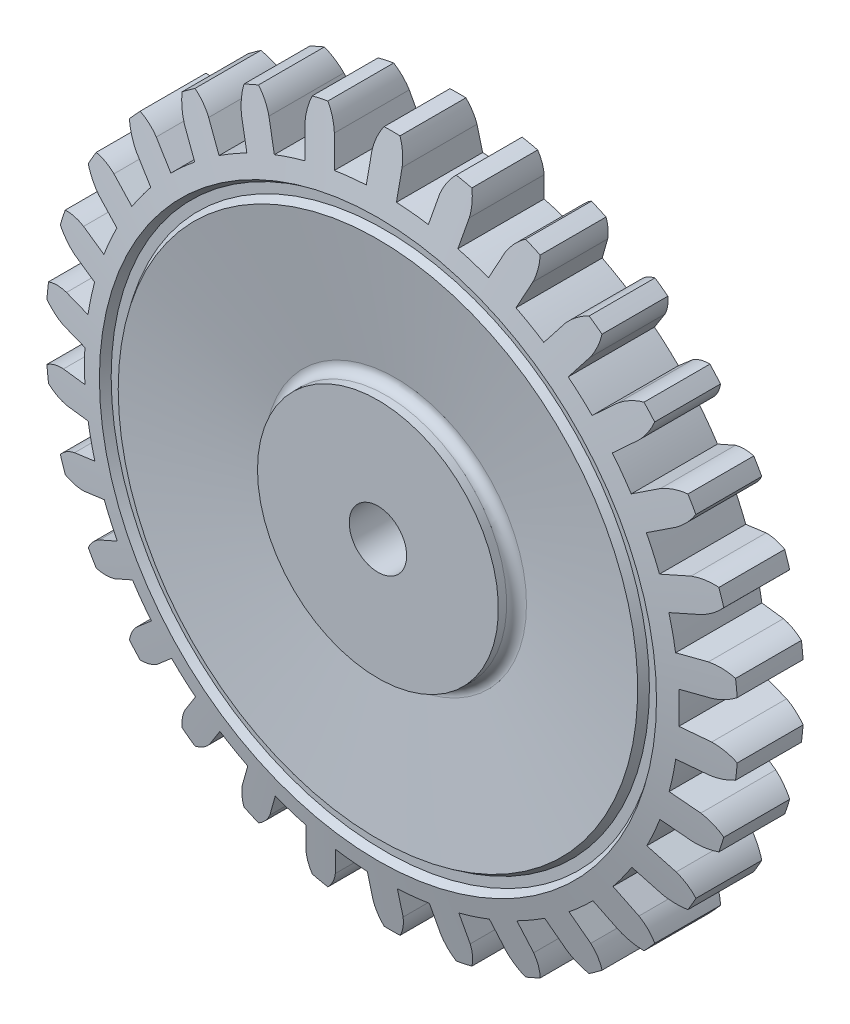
from build123d import *

# Parameters (mm, degrees)
CUT_EXTRUDE1_DEPTH      = 53.282693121
CUT_EXTRUDE1_DEPTH_BACK = 53.282693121
SKETCH4_R               = 3.05
CUT_EXTRUDE2_DEPTH      = 53.909895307


with BuildPart() as part:
    # Sketch1 → Revolve1 (revolve)
    with BuildSketch(Plane(origin=(0, 0, 0), x_dir=(0, 0, -1), z_dir=(1, 0, 0)), mode=Mode.PRIVATE) as revolve1_sk:
        with BuildLine():
            Line((-4.126108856, 12.8), (4.126108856, 12.8))
            ThreePointArc((4.126108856, 12.8), (3.378374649, 13.136001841), (3.133120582, 13.91821289))
            Line((3.133120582, 13.91821289), (5, 27.6))
            Line((5, 27.6), (4.25, 28.1))
            Line((4.25, 28.1), (4.25, 29.1))
            Line((4.25, 29.1), (5, 29.6))
            Line((5, 29.6), (3.5, 36.8))
            Line((3.5, 36.8), (-3.5, 36.8))
            Line((-3.5, 36.8), (-5, 29.6))
            Line((-5, 29.6), (-4.25, 29.1))
            Line((-4.25, 29.1), (-4.25, 28.1))
            Line((-4.25, 28.1), (-5, 27.6))
            Line((-5, 27.6), (-3.133120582, 13.91821289))
            ThreePointArc((-3.133120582, 13.91821289), (-3.378374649, 13.136001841), (-4.126108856, 12.8))
        make_face()
        Polygon((-5, 0), (5, 0), (5, 12.8), (4.126108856, 12.8), (-4.126108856, 12.8), (-5, 12.8), align=None)
    revolve(revolve1_sk.sketch.rotate(Axis((0, 0, -5), (0, 0, 1)), 90), axis=Axis((0, 0, -5), (0, 0, 1)))

    # Sketch3 → Cut-Extrude1 (cut, two sides: drawn at the far end of the back side and taken through both)
    with BuildSketch(Plane.XY.offset(-CUT_EXTRUDE1_DEPTH_BACK)):
        with BuildLine():
            ThreePointArc((-17.30140047, 26.442797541), (-15.847183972, 27.339106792), (-14.346656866, 28.155522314))
            Line((-14.346656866, 28.155522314), (-15.527676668, 30.808136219))
            ThreePointArc((-15.527676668, 30.808136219), (-15.786307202, 32.023598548), (-15.737206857, 33.265302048))
            ThreePointArc((-15.737206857, 33.265302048), (-18.40027116, 31.869578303), (-20.940508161, 30.26111561))
            ThreePointArc((-20.940508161, 30.26111561), (-19.883621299, 29.645409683), (-19.007848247, 28.791521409))
            Line((-19.007848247, 28.791521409), (-17.30140047, 26.442797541))
        make_face()
        with BuildLine():
            ThreePointArc((-8.782987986, 33.363290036), (-8.783257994, 34.605963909), (-8.477065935, 35.810324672))
            ThreePointArc((-8.477065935, 35.810324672), (-11.372123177, 34.998783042), (-14.191268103, 33.953614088))
            ThreePointArc((-14.191268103, 33.953614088), (-13.285489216, 33.131623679), (-12.60638726, 32.114311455))
            Line((-12.60638726, 32.114311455), (-11.425556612, 29.462122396))
            ThreePointArc((-11.425556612, 29.462122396), (-9.816765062, 30.036496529), (-8.179285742, 30.523094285))
            Line((-8.179285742, 30.523094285), (-8.782987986, 33.363290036))
        make_face()
        with BuildLine():
            ThreePointArc((-1.654440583, 34.460307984), (-1.396338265, 35.675882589), (-0.846436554, 36.790264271))
            ThreePointArc((-0.846436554, 36.790264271), (-3.846958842, 36.598373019), (-6.821801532, 36.162176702))
            ThreePointArc((-6.821801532, 36.162176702), (-6.106717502, 35.169826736), (-5.653966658, 34.03355199))
            Line((-5.653966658, 34.03355199), (-5.050361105, 31.193811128))
            ThreePointArc((-5.050361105, 31.193811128), (-3.357306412, 31.421147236), (-1.654440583, 31.55666057))
            Line((-1.654440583, 31.55666057), (-1.654440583, 34.460307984))
        make_face()
        with BuildLine():
            ThreePointArc((6.821186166, 36.162292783), (3.846336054, 36.598438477), (0.845810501, 36.79027867))
            ThreePointArc((0.845810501, 36.79027867), (1.338947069, 35.670939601), (1.545559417, 34.465362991))
            Line((1.545559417, 34.465362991), (1.545559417, 31.562180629))
            ThreePointArc((1.545559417, 31.562180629), (3.248882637, 31.432543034), (4.942711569, 31.211049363))
            Line((4.942711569, 31.211049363), (5.546413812, 34.051245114))
            ThreePointArc((5.546413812, 34.051245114), (6.051608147, 35.186594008), (6.821186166, 36.162292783))
        make_face()
        with BuildLine():
            ThreePointArc((14.190690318, 33.953855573), (11.371527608, 34.998976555), (8.476456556, 35.81046892))
            ThreePointArc((8.476456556, 35.81046892), (8.726093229, 34.613061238), (8.67753713, 33.390872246))
            Line((8.67753713, 33.390872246), (8.073931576, 30.551131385))
            ThreePointArc((8.073931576, 30.551131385), (9.713079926, 30.070185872), (11.323843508, 29.501365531))
            Line((11.323843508, 29.501365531), (12.504863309, 32.153979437))
            ThreePointArc((12.504863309, 32.153979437), (13.235070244, 33.159482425), (14.190690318, 33.953855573))
        make_face()
        with BuildLine():
            Line((15.43026483, 30.857040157), (14.249434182, 28.204851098))
            ThreePointArc((14.249434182, 28.204851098), (15.752769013, 27.393617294), (17.210069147, 26.502330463))
            Line((17.210069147, 26.502330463), (18.916790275, 28.851430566))
            ThreePointArc((18.916790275, 28.851430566), (19.840096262, 29.683142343), (20.93999321, 30.261471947))
            ThreePointArc((20.93999321, 30.261471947), (18.399728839, 31.869891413), (15.736640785, 33.26556984))
            ThreePointArc((15.736640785, 33.26556984), (15.731867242, 32.042426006), (15.43026483, 30.857040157))
        make_face()
        with BuildLine():
            Line((21.508615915, 26.974607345), (19.802168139, 24.625883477))
            ThreePointArc((19.802168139, 24.625883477), (21.103986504, 23.519816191), (22.344132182, 22.34501638))
            Line((22.344132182, 22.34501638), (24.501962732, 24.287935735))
            ThreePointArc((24.501962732, 24.287935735), (25.57801487, 24.909506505), (26.774117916, 25.246516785))
            ThreePointArc((26.774117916, 25.246516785), (24.623773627, 27.347939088), (22.309058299, 29.266805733))
            ThreePointArc((22.309058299, 29.266805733), (22.050083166, 28.071383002), (21.508615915, 26.974607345))
        make_face()
        with BuildLine():
            Line((26.646937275, 21.913254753), (24.489452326, 19.970646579))
            ThreePointArc((24.489452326, 19.970646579), (25.532858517, 18.61808626), (26.501649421, 17.211117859))
            Line((26.501649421, 17.211117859), (29.016281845, 18.662941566))
            ThreePointArc((29.016281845, 18.662941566), (30.198051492, 19.047205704), (31.438085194, 19.128167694))
            ThreePointArc((31.438085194, 19.128167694), (29.771641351, 21.630750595), (27.906462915, 23.988941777))
            ThreePointArc((27.906462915, 23.988941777), (27.404604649, 22.873485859), (26.646937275, 21.913254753))
        make_face()
        with BuildLine():
            Line((30.620659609, 15.894187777), (28.106429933, 14.442596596))
            ThreePointArc((28.106429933, 14.442596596), (28.845822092, 12.90265662), (29.500917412, 11.325010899))
            Line((29.500917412, 11.325010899), (32.262450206, 12.222287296))
            ThreePointArc((32.262450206, 12.222287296), (33.498288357, 12.352450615), (34.728057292, 12.173825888))
            ThreePointArc((34.728057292, 12.173825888), (33.618345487, 14.968194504), (32.284221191, 17.662645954))
            ThreePointArc((32.284221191, 17.662645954), (31.561413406, 16.675907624), (30.620659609, 15.894187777))
        make_face()
        with BuildLine():
            Line((33.256112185, 9.180468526), (30.495021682, 8.283335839))
            ThreePointArc((30.495021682, 8.283335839), (30.898084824, 6.623318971), (31.21085375, 4.943946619))
            Line((31.21085375, 4.943946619), (34.09859468, 5.247460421))
            ThreePointArc((34.09859468, 5.247460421), (35.334489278, 5.11783416), (36.500246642, 4.687429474))
            ThreePointArc((36.500246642, 4.687429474), (35.995766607, 7.651456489), (35.251004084, 10.564407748))
            ThreePointArc((35.251004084, 10.564407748), (34.338836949, 9.749512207), (33.256112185, 9.180468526))
        make_face()
        with BuildLine():
            Line((34.438113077, 2.065518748), (31.550834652, 1.762053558))
            ThreePointArc((31.550834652, 1.762053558), (31.599952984, 0.054510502), (31.556726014, -1.653191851))
            Line((31.556726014, -1.653191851), (34.444466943, -1.956705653))
            ThreePointArc((34.444466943, -1.956705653), (35.626403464, -2.340456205), (36.677200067, -3.003830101))
            ThreePointArc((36.677200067, -3.003830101), (36.7692872, -1.503169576), (36.8, 0))
            ThreePointArc((36.8, 0), (36.769274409, 1.503482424), (36.677148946, 3.00445423))
            ThreePointArc((36.677148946, 3.00445423), (35.615488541, 2.397016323), (34.438113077, 2.065518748))
        make_face()
        with BuildLine():
            Line((34.115003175, -5.13970411), (31.227724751, -4.83623892))
            ThreePointArc((31.227724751, -4.83623892), (30.920751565, -6.516680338), (30.523417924, -8.178077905))
            Line((30.523417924, -8.178077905), (33.284950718, -9.075354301))
            ThreePointArc((33.284950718, -9.075354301), (34.361272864, -9.696457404), (35.251183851, -10.563807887))
            ThreePointArc((35.251183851, -10.563807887), (35.995896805, -7.650843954), (36.500326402, -4.686808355))
            ThreePointArc((36.500326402, -4.686808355), (35.335572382, -5.060240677), (34.115003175, -5.13970411))
        make_face()
        with BuildLine():
            Line((32.300903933, -12.120297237), (29.53981343, -11.223164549))
            ThreePointArc((29.53981343, -11.223164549), (28.890164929, -12.803060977), (28.156090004, -14.345542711))
            Line((28.156090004, -14.345542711), (30.670722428, -15.797366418))
            ThreePointArc((30.670722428, -15.797366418), (31.594389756, -16.628676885), (32.284521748, -17.662096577))
            ThreePointArc((32.284521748, -17.662096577), (33.618600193, -14.967622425), (34.728264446, -12.173234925))
            ThreePointArc((34.728264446, -12.173234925), (33.511322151, -12.296340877), (32.300903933, -12.120297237))
        make_face()
        with BuildLine():
            Line((29.075100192, -18.571175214), (26.560870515, -17.119584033))
            ThreePointArc((26.560870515, -17.119584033), (25.596939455, -18.529886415), (24.558205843, -19.886038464))
            Line((24.558205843, -19.886038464), (26.716036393, -21.828957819))
            ThreePointArc((26.716036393, -21.828957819), (27.44668021, -22.834143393), (27.906871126, -23.988466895))
            ThreePointArc((27.906871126, -23.988466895), (29.772009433, -21.630243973), (31.43841069, -19.127632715))
            ThreePointArc((31.43841069, -19.127632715), (30.222466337, -18.995031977), (29.075100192, -18.571175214))
        make_face()
        with BuildLine():
            Line((24.578575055, -24.21040372), (22.421090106, -22.267795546))
            ThreePointArc((22.421090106, -22.267795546), (21.185004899, -23.4468669), (19.887010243, -24.557418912))
            Line((19.887010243, -24.557418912), (21.59373137, -26.906519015))
            ThreePointArc((21.59373137, -26.906519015), (22.099419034, -28.041648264), (22.309556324, -29.266426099))
            ThreePointArc((22.309556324, -29.266426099), (24.624238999, -27.347520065), (26.774547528, -25.246061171))
            ThreePointArc((26.774547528, -25.246061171), (25.61274372, -24.863549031), (24.578575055, -24.21040372))
        make_face()
        with BuildLine():
            Line((19.007848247, -28.791521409), (17.30140047, -26.442797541))
            ThreePointArc((17.30140047, -26.442797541), (15.847183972, -27.339106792), (14.346656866, -28.155522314))
            Line((14.346656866, -28.155522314), (15.527676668, -30.808136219))
            ThreePointArc((15.527676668, -30.808136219), (15.786307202, -32.023598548), (15.737206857, -33.265302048))
            ThreePointArc((15.737206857, -33.265302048), (18.40027116, -31.869578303), (20.940508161, -30.26111561))
            ThreePointArc((20.940508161, -30.26111561), (19.883621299, -29.645409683), (19.007848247, -28.791521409))
        make_face()
        with BuildLine():
            Line((12.60638726, -32.114311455), (11.425556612, -29.462122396))
            ThreePointArc((11.425556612, -29.462122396), (9.816765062, -30.036496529), (8.179285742, -30.523094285))
            Line((8.179285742, -30.523094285), (8.782987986, -33.363290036))
            ThreePointArc((8.782987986, -33.363290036), (8.783257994, -34.605963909), (8.477065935, -35.810324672))
            ThreePointArc((8.477065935, -35.810324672), (11.372123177, -34.998783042), (14.191268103, -33.953614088))
            ThreePointArc((14.191268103, -33.953614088), (13.285489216, -33.131623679), (12.60638726, -32.114311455))
        make_face()
        with BuildLine():
            Line((5.653966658, -34.03355199), (5.050361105, -31.193811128))
            ThreePointArc((5.050361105, -31.193811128), (3.357306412, -31.421147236), (1.654440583, -31.55666057))
            Line((1.654440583, -31.55666057), (1.654440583, -34.460307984))
            ThreePointArc((1.654440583, -34.460307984), (1.396338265, -35.675882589), (0.846436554, -36.790264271))
            ThreePointArc((0.846436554, -36.790264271), (3.846958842, -36.598373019), (6.821801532, -36.162176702))
            ThreePointArc((6.821801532, -36.162176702), (6.106717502, -35.169826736), (5.653966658, -34.03355199))
        make_face()
        with BuildLine():
            ThreePointArc((-1.545559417, -31.562180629), (-3.248882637, -31.432543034), (-4.942711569, -31.211049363))
            Line((-4.942711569, -31.211049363), (-5.546413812, -34.051245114))
            ThreePointArc((-5.546413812, -34.051245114), (-6.051608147, -35.186594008), (-6.821186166, -36.162292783))
            ThreePointArc((-6.821186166, -36.162292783), (-3.846336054, -36.598438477), (-0.845810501, -36.79027867))
            ThreePointArc((-0.845810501, -36.79027867), (-1.338947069, -35.670939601), (-1.545559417, -34.465362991))
            Line((-1.545559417, -34.465362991), (-1.545559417, -31.562180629))
        make_face()
        with BuildLine():
            ThreePointArc((-8.073931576, -30.551131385), (-9.713079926, -30.070185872), (-11.323843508, -29.501365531))
            Line((-11.323843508, -29.501365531), (-12.504863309, -32.153979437))
            ThreePointArc((-12.504863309, -32.153979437), (-13.235070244, -33.159482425), (-14.190690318, -33.953855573))
            ThreePointArc((-14.190690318, -33.953855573), (-11.371527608, -34.998976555), (-8.476456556, -35.81046892))
            ThreePointArc((-8.476456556, -35.81046892), (-8.726093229, -34.613061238), (-8.67753713, -33.390872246))
            Line((-8.67753713, -33.390872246), (-8.073931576, -30.551131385))
        make_face()
        with BuildLine():
            ThreePointArc((-14.249434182, -28.204851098), (-15.752769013, -27.393617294), (-17.210069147, -26.502330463))
            Line((-17.210069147, -26.502330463), (-18.916790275, -28.851430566))
            ThreePointArc((-18.916790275, -28.851430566), (-19.840096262, -29.683142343), (-20.93999321, -30.261471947))
            ThreePointArc((-20.93999321, -30.261471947), (-18.399728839, -31.869891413), (-15.736640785, -33.26556984))
            ThreePointArc((-15.736640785, -33.26556984), (-15.731867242, -32.042426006), (-15.43026483, -30.857040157))
            Line((-15.43026483, -30.857040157), (-14.249434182, -28.204851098))
        make_face()
        with BuildLine():
            ThreePointArc((-19.802168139, -24.625883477), (-21.103986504, -23.519816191), (-22.344132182, -22.34501638))
            Line((-22.344132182, -22.34501638), (-24.501962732, -24.287935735))
            ThreePointArc((-24.501962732, -24.287935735), (-25.57801487, -24.909506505), (-26.774117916, -25.246516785))
            ThreePointArc((-26.774117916, -25.246516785), (-24.623773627, -27.347939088), (-22.309058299, -29.266805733))
            ThreePointArc((-22.309058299, -29.266805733), (-22.050083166, -28.071383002), (-21.508615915, -26.974607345))
            Line((-21.508615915, -26.974607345), (-19.802168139, -24.625883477))
        make_face()
        with BuildLine():
            ThreePointArc((-24.489452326, -19.970646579), (-25.532858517, -18.61808626), (-26.501649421, -17.211117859))
            Line((-26.501649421, -17.211117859), (-29.016281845, -18.662941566))
            ThreePointArc((-29.016281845, -18.662941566), (-30.198051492, -19.047205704), (-31.438085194, -19.128167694))
            ThreePointArc((-31.438085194, -19.128167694), (-29.771641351, -21.630750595), (-27.906462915, -23.988941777))
            ThreePointArc((-27.906462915, -23.988941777), (-27.404604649, -22.873485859), (-26.646937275, -21.913254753))
            Line((-26.646937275, -21.913254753), (-24.489452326, -19.970646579))
        make_face()
        with BuildLine():
            ThreePointArc((-28.106429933, -14.442596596), (-28.845822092, -12.90265662), (-29.500917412, -11.325010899))
            Line((-29.500917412, -11.325010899), (-32.262450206, -12.222287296))
            ThreePointArc((-32.262450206, -12.222287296), (-33.498288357, -12.352450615), (-34.728057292, -12.173825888))
            ThreePointArc((-34.728057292, -12.173825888), (-33.618345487, -14.968194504), (-32.284221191, -17.662645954))
            ThreePointArc((-32.284221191, -17.662645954), (-31.561413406, -16.675907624), (-30.620659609, -15.894187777))
            Line((-30.620659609, -15.894187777), (-28.106429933, -14.442596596))
        make_face()
        with BuildLine():
            ThreePointArc((-30.495021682, -8.283335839), (-30.898084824, -6.623318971), (-31.21085375, -4.943946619))
            Line((-31.21085375, -4.943946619), (-34.09859468, -5.247460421))
            ThreePointArc((-34.09859468, -5.247460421), (-35.334489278, -5.11783416), (-36.500246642, -4.687429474))
            ThreePointArc((-36.500246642, -4.687429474), (-35.995766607, -7.651456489), (-35.251004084, -10.564407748))
            ThreePointArc((-35.251004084, -10.564407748), (-34.338836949, -9.749512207), (-33.256112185, -9.180468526))
            Line((-33.256112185, -9.180468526), (-30.495021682, -8.283335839))
        make_face()
        with BuildLine():
            ThreePointArc((-31.550834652, -1.762053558), (-31.599952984, -0.054510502), (-31.556726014, 1.653191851))
            Line((-31.556726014, 1.653191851), (-34.444466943, 1.956705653))
            ThreePointArc((-34.444466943, 1.956705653), (-35.626403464, 2.340456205), (-36.677200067, 3.003830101))
            ThreePointArc((-36.677200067, 3.003830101), (-36.799999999, -0.00031311), (-36.677148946, -3.00445423))
            ThreePointArc((-36.677148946, -3.00445423), (-35.615488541, -2.397016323), (-34.438113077, -2.065518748))
            Line((-34.438113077, -2.065518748), (-31.550834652, -1.762053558))
        make_face()
        with BuildLine():
            ThreePointArc((-31.227724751, 4.83623892), (-30.920751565, 6.516680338), (-30.523417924, 8.178077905))
            Line((-30.523417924, 8.178077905), (-33.284950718, 9.075354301))
            ThreePointArc((-33.284950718, 9.075354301), (-34.361272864, 9.696457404), (-35.251183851, 10.563807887))
            ThreePointArc((-35.251183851, 10.563807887), (-35.995896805, 7.650843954), (-36.500326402, 4.686808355))
            ThreePointArc((-36.500326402, 4.686808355), (-35.335572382, 5.060240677), (-34.115003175, 5.13970411))
            Line((-34.115003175, 5.13970411), (-31.227724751, 4.83623892))
        make_face()
        with BuildLine():
            ThreePointArc((-29.53981343, 11.223164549), (-28.890164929, 12.803060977), (-28.156090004, 14.345542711))
            Line((-28.156090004, 14.345542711), (-30.670722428, 15.797366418))
            ThreePointArc((-30.670722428, 15.797366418), (-31.594389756, 16.628676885), (-32.284521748, 17.662096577))
            ThreePointArc((-32.284521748, 17.662096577), (-33.618600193, 14.967622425), (-34.728264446, 12.173234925))
            ThreePointArc((-34.728264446, 12.173234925), (-33.511322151, 12.296340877), (-32.300903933, 12.120297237))
            Line((-32.300903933, 12.120297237), (-29.53981343, 11.223164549))
        make_face()
        with BuildLine():
            ThreePointArc((-26.560870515, 17.119584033), (-25.596939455, 18.529886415), (-24.558205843, 19.886038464))
            Line((-24.558205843, 19.886038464), (-26.716036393, 21.828957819))
            ThreePointArc((-26.716036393, 21.828957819), (-27.44668021, 22.834143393), (-27.906871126, 23.988466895))
            ThreePointArc((-27.906871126, 23.988466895), (-29.772009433, 21.630243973), (-31.43841069, 19.127632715))
            ThreePointArc((-31.43841069, 19.127632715), (-30.222466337, 18.995031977), (-29.075100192, 18.571175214))
            Line((-29.075100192, 18.571175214), (-26.560870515, 17.119584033))
        make_face()
        with BuildLine():
            ThreePointArc((-22.421090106, 22.267795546), (-21.185004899, 23.4468669), (-19.887010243, 24.557418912))
            Line((-19.887010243, 24.557418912), (-21.59373137, 26.906519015))
            ThreePointArc((-21.59373137, 26.906519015), (-22.099419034, 28.041648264), (-22.309556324, 29.266426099))
            ThreePointArc((-22.309556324, 29.266426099), (-24.624238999, 27.347520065), (-26.774547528, 25.246061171))
            ThreePointArc((-26.774547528, 25.246061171), (-25.61274372, 24.863549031), (-24.578575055, 24.21040372))
            Line((-24.578575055, 24.21040372), (-22.421090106, 22.267795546))
        make_face()
    extrude(amount=CUT_EXTRUDE1_DEPTH + CUT_EXTRUDE1_DEPTH_BACK, mode=Mode.SUBTRACT)

    # Sketch4 → Cut-Extrude2 (cut, through all)
    with BuildSketch(Plane(origin=(0, 0, -5), x_dir=(-1, 0, 0), z_dir=(0, 0, -1))):
        Circle(SKETCH4_R)
    extrude(amount=-CUT_EXTRUDE2_DEPTH, mode=Mode.SUBTRACT)


solid = part.part
